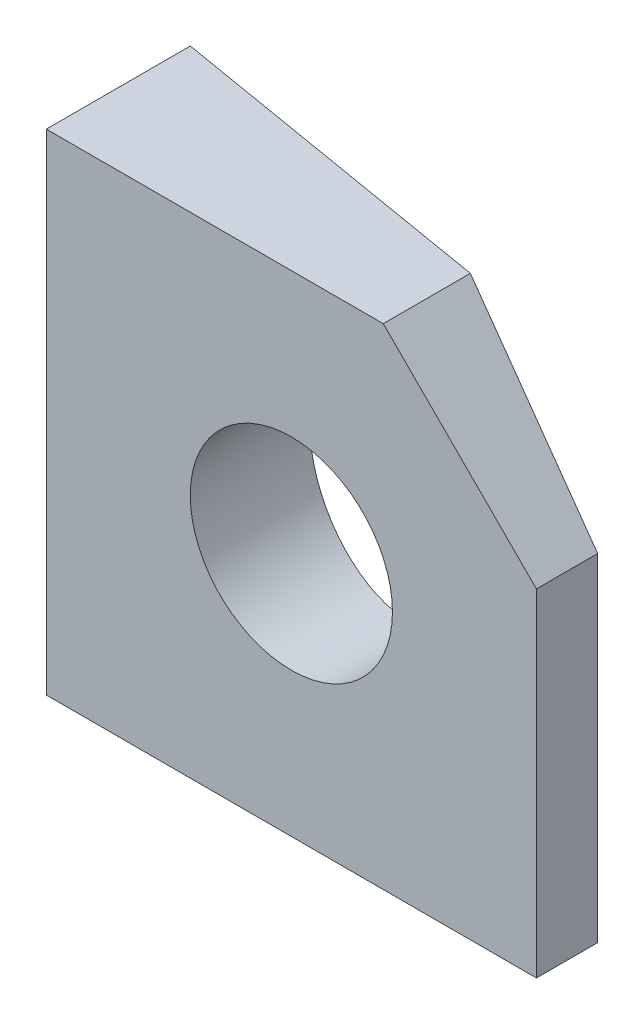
ISO-10303-21;
HEADER;
FILE_DESCRIPTION(('STEP AP214'),'2;1');
FILE_NAME('part.step','',(''),(''),'','','');
FILE_SCHEMA(('AUTOMOTIVE_DESIGN { 1 0 10303 214 1 1 1 1 }'));
ENDSEC;
DATA;
#1=APPLICATION_CONTEXT('core data for automotive mechanical design processes');
#2=APPLICATION_PROTOCOL_DEFINITION('international standard','automotive_design',2000,#1);
#3=PRODUCT_CONTEXT('',#1,'mechanical');
#4=PRODUCT('Part','Part','',(#3));
#5=PRODUCT_RELATED_PRODUCT_CATEGORY('part','',(#4));
#6=PRODUCT_DEFINITION_FORMATION('','',#4);
#7=PRODUCT_DEFINITION_CONTEXT('part definition',#1,'design');
#8=PRODUCT_DEFINITION('design','',#6,#7);
#9=PRODUCT_DEFINITION_SHAPE('','',#8);
#10=(LENGTH_UNIT() NAMED_UNIT(*) SI_UNIT(.MILLI.,.METRE.));
#11=(NAMED_UNIT(*) PLANE_ANGLE_UNIT() SI_UNIT($,.RADIAN.));
#12=(NAMED_UNIT(*) SI_UNIT($,.STERADIAN.) SOLID_ANGLE_UNIT());
#13=UNCERTAINTY_MEASURE_WITH_UNIT(LENGTH_MEASURE(1.E-05),#10,'distance_accuracy_value','');
#14=(GEOMETRIC_REPRESENTATION_CONTEXT(3) GLOBAL_UNCERTAINTY_ASSIGNED_CONTEXT((#13)) GLOBAL_UNIT_ASSIGNED_CONTEXT((#10,
#11,#12)) REPRESENTATION_CONTEXT('',''));
#15=CARTESIAN_POINT('',(0.,0.,0.));
#16=DIRECTION('',(0.,0.,1.));
#17=DIRECTION('',(1.,0.,0.));
#18=AXIS2_PLACEMENT_3D('',#15,#16,#17);
#19=CARTESIAN_POINT('',(7.99999999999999,-7.99999999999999,-4.7));
#20=DIRECTION('',(1.,0.,0.));
#21=DIRECTION('',(0.,1.,0.));
#22=AXIS2_PLACEMENT_3D('',#19,#20,#21);
#23=PLANE('',#22);
#24=DIRECTION('',(0.,1.,0.));
#25=VECTOR('',#24,1.);
#26=CARTESIAN_POINT('',(7.99999999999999,-8.00000000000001,-2.));
#27=LINE('',#26,#25);
#28=CARTESIAN_POINT('',(7.99999999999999,-8.00000000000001,-2.));
#29=VERTEX_POINT('',#28);
#30=CARTESIAN_POINT('',(7.99999999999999,3.,-2.));
#31=VERTEX_POINT('',#30);
#32=EDGE_CURVE('E83',#29,#31,#27,.T.);
#33=ORIENTED_EDGE('',*,*,#32,.T.);
#34=DIRECTION('',(0.,0.,1.));
#35=VECTOR('',#34,1.);
#36=CARTESIAN_POINT('',(7.99999999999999,3.,-4.7));
#37=LINE('',#36,#35);
#38=CARTESIAN_POINT('',(7.99999999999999,3.,0.));
#39=VERTEX_POINT('',#38);
#40=EDGE_CURVE('E108',#31,#39,#37,.T.);
#41=ORIENTED_EDGE('',*,*,#40,.T.);
#42=DIRECTION('',(0.,1.,0.));
#43=VECTOR('',#42,1.);
#44=CARTESIAN_POINT('',(7.99999999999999,-7.99999999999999,0.));
#45=LINE('',#44,#43);
#46=CARTESIAN_POINT('',(7.99999999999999,-7.99999999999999,0.));
#47=VERTEX_POINT('',#46);
#48=EDGE_CURVE('E106',#47,#39,#45,.T.);
#49=ORIENTED_EDGE('',*,*,#48,.F.);
#50=DIRECTION('',(0.,0.,1.));
#51=VECTOR('',#50,1.);
#52=CARTESIAN_POINT('',(7.99999999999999,-7.99999999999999,-4.7));
#53=LINE('',#52,#51);
#54=EDGE_CURVE('E99',#29,#47,#53,.T.);
#55=ORIENTED_EDGE('',*,*,#54,.F.);
#56=EDGE_LOOP('',(#33,#41,#49,#55));
#57=FACE_BOUND('',#56,.T.);
#58=ADVANCED_FACE('F39',(#57),#23,.T.);
#59=CARTESIAN_POINT('',(-8.,-8.00000000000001,-4.7));
#60=DIRECTION('',(0.,-1.,0.));
#61=DIRECTION('',(1.,0.,0.));
#62=AXIS2_PLACEMENT_3D('',#59,#60,#61);
#63=PLANE('',#62);
#64=DIRECTION('',(0.986058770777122,0.,0.166397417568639));
#65=VECTOR('',#64,1.);
#66=CARTESIAN_POINT('',(-8.00000000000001,-8.00000000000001,-4.7));
#67=LINE('',#66,#65);
#68=CARTESIAN_POINT('',(-8.,-8.00000000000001,-4.7));
#69=VERTEX_POINT('',#68);
#70=EDGE_CURVE('E86',#69,#29,#67,.T.);
#71=ORIENTED_EDGE('',*,*,#70,.T.);
#72=ORIENTED_EDGE('',*,*,#54,.T.);
#73=DIRECTION('',(1.,0.,0.));
#74=VECTOR('',#73,1.);
#75=CARTESIAN_POINT('',(-8.,-8.00000000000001,0.));
#76=LINE('',#75,#74);
#77=CARTESIAN_POINT('',(-8.,-8.00000000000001,0.));
#78=VERTEX_POINT('',#77);
#79=EDGE_CURVE('E112',#78,#47,#76,.T.);
#80=ORIENTED_EDGE('',*,*,#79,.F.);
#81=DIRECTION('',(0.,0.,1.));
#82=VECTOR('',#81,1.);
#83=CARTESIAN_POINT('',(-8.,-8.00000000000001,-4.7));
#84=LINE('',#83,#82);
#85=EDGE_CURVE('E105',#69,#78,#84,.T.);
#86=ORIENTED_EDGE('',*,*,#85,.F.);
#87=EDGE_LOOP('',(#71,#72,#80,#86));
#88=FACE_BOUND('',#87,.T.);
#89=ADVANCED_FACE('F96',(#88),#63,.T.);
#90=CARTESIAN_POINT('',(-8.00000000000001,8.,-4.7));
#91=DIRECTION('',(-1.,0.,0.));
#92=DIRECTION('',(0.,-1.,0.));
#93=AXIS2_PLACEMENT_3D('',#90,#91,#92);
#94=PLANE('',#93);
#95=DIRECTION('',(0.,-1.,0.));
#96=VECTOR('',#95,1.);
#97=CARTESIAN_POINT('',(-8.00000000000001,8.,0.));
#98=LINE('',#97,#96);
#99=CARTESIAN_POINT('',(-8.00000000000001,8.,0.));
#100=VERTEX_POINT('',#99);
#101=EDGE_CURVE('E132',#100,#78,#98,.T.);
#102=ORIENTED_EDGE('',*,*,#101,.F.);
#103=DIRECTION('',(0.,0.,1.));
#104=VECTOR('',#103,1.);
#105=CARTESIAN_POINT('',(-8.00000000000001,8.,-4.7));
#106=LINE('',#105,#104);
#107=CARTESIAN_POINT('',(-8.00000000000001,7.99999999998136,-4.7));
#108=VERTEX_POINT('',#107);
#109=EDGE_CURVE('E111',#108,#100,#106,.T.);
#110=ORIENTED_EDGE('',*,*,#109,.F.);
#111=DIRECTION('',(0.,-1.,0.));
#112=VECTOR('',#111,1.);
#113=CARTESIAN_POINT('',(-8.00000000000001,8.,-4.7));
#114=LINE('',#113,#112);
#115=EDGE_CURVE('E118',#108,#69,#114,.T.);
#116=ORIENTED_EDGE('',*,*,#115,.T.);
#117=ORIENTED_EDGE('',*,*,#85,.T.);
#118=EDGE_LOOP('',(#102,#110,#116,#117));
#119=FACE_BOUND('',#118,.T.);
#120=ADVANCED_FACE('F148',(#119),#94,.T.);
#121=CARTESIAN_POINT('',(7.99999999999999,8.,-4.7));
#122=DIRECTION('',(0.,1.,0.));
#123=DIRECTION('',(0.,0.,1.));
#124=AXIS2_PLACEMENT_3D('',#121,#122,#123);
#125=PLANE('',#124);
#126=DIRECTION('',(-1.,0.,0.));
#127=VECTOR('',#126,1.);
#128=CARTESIAN_POINT('',(7.99999999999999,8.,0.));
#129=LINE('',#128,#127);
#130=CARTESIAN_POINT('',(2.99999999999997,8.,0.));
#131=VERTEX_POINT('',#130);
#132=EDGE_CURVE('E128',#131,#100,#129,.T.);
#133=ORIENTED_EDGE('',*,*,#132,.F.);
#134=DIRECTION('',(0.,0.,-1.));
#135=VECTOR('',#134,1.);
#136=CARTESIAN_POINT('',(2.99999999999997,8.,-4.7));
#137=LINE('',#136,#135);
#138=CARTESIAN_POINT('',(2.99999999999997,7.99999999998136,-2.84375));
#139=VERTEX_POINT('',#138);
#140=EDGE_CURVE('E50',#131,#139,#137,.T.);
#141=ORIENTED_EDGE('',*,*,#140,.T.);
#142=DIRECTION('',(0.986058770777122,0.,0.166397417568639));
#143=VECTOR('',#142,1.);
#144=CARTESIAN_POINT('',(-8.00000000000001,7.99999999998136,-4.7));
#145=LINE('',#144,#143);
#146=EDGE_CURVE('E104',#108,#139,#145,.T.);
#147=ORIENTED_EDGE('',*,*,#146,.F.);
#148=ORIENTED_EDGE('',*,*,#109,.T.);
#149=EDGE_LOOP('',(#133,#141,#147,#148));
#150=FACE_BOUND('',#149,.T.);
#151=ADVANCED_FACE('F137',(#150),#125,.T.);
#152=CARTESIAN_POINT('',(7.99999999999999,8.,0.));
#153=DIRECTION('',(0.,0.,1.));
#154=DIRECTION('',(1.,0.,0.));
#155=AXIS2_PLACEMENT_3D('',#152,#153,#154);
#156=PLANE('',#155);
#157=CARTESIAN_POINT('',(0.,0.,0.));
#158=DIRECTION('',(0.,0.,1.));
#159=DIRECTION('',(1.,0.,0.));
#160=AXIS2_PLACEMENT_3D('',#157,#158,#159);
#161=CIRCLE('',#160,3.3);
#162=CARTESIAN_POINT('',(3.3,0.,0.));
#163=VERTEX_POINT('',#162);
#164=EDGE_CURVE('E122',#163,#163,#161,.T.);
#165=ORIENTED_EDGE('',*,*,#164,.F.);
#166=EDGE_LOOP('',(#165));
#167=FACE_BOUND('',#166,.T.);
#168=ORIENTED_EDGE('',*,*,#48,.T.);
#169=DIRECTION('',(0.707106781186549,-0.707106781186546,0.));
#170=VECTOR('',#169,1.);
#171=CARTESIAN_POINT('',(5.49999999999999,5.49999999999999,0.));
#172=LINE('',#171,#170);
#173=EDGE_CURVE('E61',#39,#131,#172,.F.);
#174=ORIENTED_EDGE('',*,*,#173,.T.);
#175=ORIENTED_EDGE('',*,*,#132,.T.);
#176=ORIENTED_EDGE('',*,*,#101,.T.);
#177=ORIENTED_EDGE('',*,*,#79,.T.);
#178=EDGE_LOOP('',(#168,#174,#175,#176,#177));
#179=FACE_BOUND('',#178,.T.);
#180=ADVANCED_FACE('F140',(#167,#179),#156,.T.);
#181=CARTESIAN_POINT('',(0.,0.,-4.7));
#182=DIRECTION('',(0.,0.,1.));
#183=DIRECTION('',(1.,0.,0.));
#184=AXIS2_PLACEMENT_3D('',#181,#182,#183);
#185=CYLINDRICAL_SURFACE('',#184,3.3);
#186=CARTESIAN_POINT('',(0.,0.,-3.35));
#187=DIRECTION('',(-0.166397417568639,0.,0.986058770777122));
#188=DIRECTION('',(0.986058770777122,0.,0.166397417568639));
#189=AXIS2_PLACEMENT_3D('',#186,#187,#188);
#190=ELLIPSE('',#189,3.34665650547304,3.3);
#191=CARTESIAN_POINT('',(3.3,0.,-2.793125));
#192=VERTEX_POINT('',#191);
#193=EDGE_CURVE('E92',#192,#192,#190,.F.);
#194=ORIENTED_EDGE('',*,*,#193,.T.);
#195=EDGE_LOOP('',(#194));
#196=FACE_BOUND('',#195,.T.);
#197=ORIENTED_EDGE('',*,*,#164,.T.);
#198=EDGE_LOOP('',(#197));
#199=FACE_BOUND('',#198,.T.);
#200=ADVANCED_FACE('F139',(#196,#199),#185,.F.);
#201=CARTESIAN_POINT('',(-8.00000000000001,-8.00000000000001,-4.7));
#202=DIRECTION('',(-0.166397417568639,0.,0.986058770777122));
#203=DIRECTION('',(0.986058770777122,0.,0.166397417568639));
#204=AXIS2_PLACEMENT_3D('',#201,#202,#203);
#205=PLANE('',#204);
#206=ORIENTED_EDGE('',*,*,#146,.T.);
#207=DIRECTION('',(-0.702125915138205,0.702125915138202,-0.118483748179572));
#208=VECTOR('',#207,1.);
#209=CARTESIAN_POINT('',(7.7753856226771,3.22461437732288,-2.03790367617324));
#210=LINE('',#209,#208);
#211=EDGE_CURVE('E11',#139,#31,#210,.F.);
#212=ORIENTED_EDGE('',*,*,#211,.T.);
#213=ORIENTED_EDGE('',*,*,#32,.F.);
#214=ORIENTED_EDGE('',*,*,#70,.F.);
#215=ORIENTED_EDGE('',*,*,#115,.F.);
#216=EDGE_LOOP('',(#206,#212,#213,#214,#215));
#217=FACE_BOUND('',#216,.T.);
#218=ORIENTED_EDGE('',*,*,#193,.F.);
#219=EDGE_LOOP('',(#218));
#220=FACE_BOUND('',#219,.T.);
#221=ADVANCED_FACE('F88',(#217,#220),#205,.F.);
#222=CARTESIAN_POINT('',(7.99999999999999,3.,-4.7));
#223=DIRECTION('',(-0.707106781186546,-0.707106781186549,0.));
#224=DIRECTION('',(0.707106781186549,-0.707106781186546,0.));
#225=AXIS2_PLACEMENT_3D('',#222,#223,#224);
#226=PLANE('',#225);
#227=ORIENTED_EDGE('',*,*,#211,.F.);
#228=ORIENTED_EDGE('',*,*,#140,.F.);
#229=ORIENTED_EDGE('',*,*,#173,.F.);
#230=ORIENTED_EDGE('',*,*,#40,.F.);
#231=EDGE_LOOP('',(#227,#228,#229,#230));
#232=FACE_BOUND('',#231,.T.);
#233=ADVANCED_FACE('F41',(#232),#226,.F.);
#234=CLOSED_SHELL('',(#58,#89,#120,#151,#180,#200,#221,#233));
#235=MANIFOLD_SOLID_BREP('B2',#234);
#236=ADVANCED_BREP_SHAPE_REPRESENTATION('',(#18,#235),#14);
#237=SHAPE_DEFINITION_REPRESENTATION(#9,#236);
ENDSEC;
END-ISO-10303-21;
